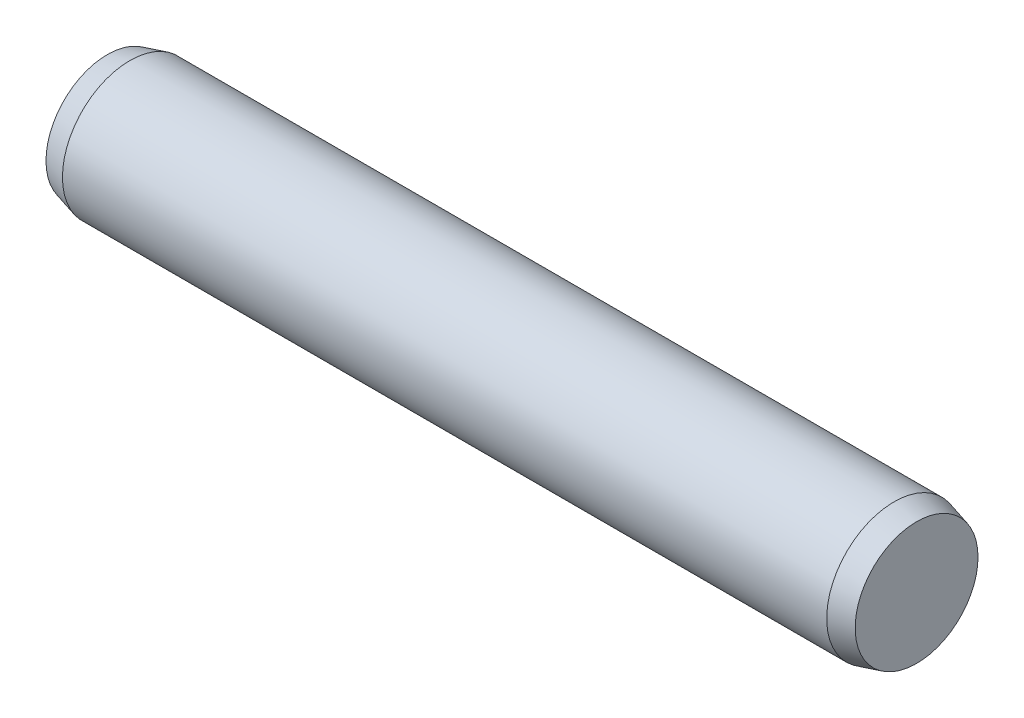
ISO-10303-21;
HEADER;
FILE_DESCRIPTION(('STEP AP214'),'2;1');
FILE_NAME('part.step','',(''),(''),'','','');
FILE_SCHEMA(('AUTOMOTIVE_DESIGN { 1 0 10303 214 1 1 1 1 }'));
ENDSEC;
DATA;
#1=APPLICATION_CONTEXT('core data for automotive mechanical design processes');
#2=APPLICATION_PROTOCOL_DEFINITION('international standard','automotive_design',2000,#1);
#3=PRODUCT_CONTEXT('',#1,'mechanical');
#4=PRODUCT('Part','Part','',(#3));
#5=PRODUCT_RELATED_PRODUCT_CATEGORY('part','',(#4));
#6=PRODUCT_DEFINITION_FORMATION('','',#4);
#7=PRODUCT_DEFINITION_CONTEXT('part definition',#1,'design');
#8=PRODUCT_DEFINITION('design','',#6,#7);
#9=PRODUCT_DEFINITION_SHAPE('','',#8);
#10=(LENGTH_UNIT() NAMED_UNIT(*) SI_UNIT(.MILLI.,.METRE.));
#11=(NAMED_UNIT(*) PLANE_ANGLE_UNIT() SI_UNIT($,.RADIAN.));
#12=(NAMED_UNIT(*) SI_UNIT($,.STERADIAN.) SOLID_ANGLE_UNIT());
#13=UNCERTAINTY_MEASURE_WITH_UNIT(LENGTH_MEASURE(1.E-05),#10,'distance_accuracy_value','');
#14=(GEOMETRIC_REPRESENTATION_CONTEXT(3) GLOBAL_UNCERTAINTY_ASSIGNED_CONTEXT((#13)) GLOBAL_UNIT_ASSIGNED_CONTEXT((#10,
#11,#12)) REPRESENTATION_CONTEXT('',''));
#15=CARTESIAN_POINT('',(0.,0.,0.));
#16=DIRECTION('',(0.,0.,1.));
#17=DIRECTION('',(1.,0.,0.));
#18=AXIS2_PLACEMENT_3D('',#15,#16,#17);
#19=CARTESIAN_POINT('',(-8.5,0.,0.));
#20=DIRECTION('',(1.,0.,0.));
#21=DIRECTION('',(0.,0.,-1.));
#22=AXIS2_PLACEMENT_3D('',#19,#20,#21);
#23=CYLINDRICAL_SURFACE('',#22,1.5);
#24=CARTESIAN_POINT('',(-8.5,0.,0.));
#25=DIRECTION('',(-1.,0.,0.));
#26=DIRECTION('',(0.,0.,1.));
#27=AXIS2_PLACEMENT_3D('',#24,#25,#26);
#28=CIRCLE('',#27,1.5);
#29=CARTESIAN_POINT('',(-8.5,0.,1.5));
#30=VERTEX_POINT('',#29);
#31=EDGE_CURVE('E47',#30,#30,#28,.T.);
#32=ORIENTED_EDGE('',*,*,#31,.F.);
#33=EDGE_LOOP('',(#32));
#34=FACE_BOUND('',#33,.T.);
#35=CARTESIAN_POINT('',(8.5,0.,0.));
#36=DIRECTION('',(1.,0.,0.));
#37=DIRECTION('',(0.,0.,-1.));
#38=AXIS2_PLACEMENT_3D('',#35,#36,#37);
#39=CIRCLE('',#38,1.5);
#40=CARTESIAN_POINT('',(8.5,0.,-1.5));
#41=VERTEX_POINT('',#40);
#42=EDGE_CURVE('E10',#41,#41,#39,.T.);
#43=ORIENTED_EDGE('',*,*,#42,.F.);
#44=EDGE_LOOP('',(#43));
#45=FACE_BOUND('',#44,.T.);
#46=ADVANCED_FACE('F33',(#34,#45),#23,.T.);
#47=CARTESIAN_POINT('',(8.5,0.,0.));
#48=DIRECTION('',(-1.,0.,0.));
#49=DIRECTION('',(0.,0.,-1.));
#50=AXIS2_PLACEMENT_3D('',#47,#48,#49);
#51=CONICAL_SURFACE('',#50,1.5,0.26179938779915);
#52=CARTESIAN_POINT('',(9.,0.,0.));
#53=DIRECTION('',(1.,0.,0.));
#54=DIRECTION('',(0.,0.,-1.));
#55=AXIS2_PLACEMENT_3D('',#52,#53,#54);
#56=CIRCLE('',#55,1.36602540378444);
#57=CARTESIAN_POINT('',(9.,0.,-1.36602540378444));
#58=VERTEX_POINT('',#57);
#59=EDGE_CURVE('E39',#58,#58,#56,.T.);
#60=ORIENTED_EDGE('',*,*,#59,.F.);
#61=EDGE_LOOP('',(#60));
#62=FACE_BOUND('',#61,.T.);
#63=ORIENTED_EDGE('',*,*,#42,.T.);
#64=EDGE_LOOP('',(#63));
#65=FACE_BOUND('',#64,.T.);
#66=ADVANCED_FACE('F57',(#62,#65),#51,.T.);
#67=CARTESIAN_POINT('',(9.,0.,0.));
#68=DIRECTION('',(1.,0.,0.));
#69=DIRECTION('',(0.,0.,-1.));
#70=AXIS2_PLACEMENT_3D('',#67,#68,#69);
#71=PLANE('',#70);
#72=ORIENTED_EDGE('',*,*,#59,.T.);
#73=EDGE_LOOP('',(#72));
#74=FACE_BOUND('',#73,.T.);
#75=ADVANCED_FACE('F61',(#74),#71,.T.);
#76=CARTESIAN_POINT('',(-8.5,0.,0.));
#77=DIRECTION('',(1.,0.,0.));
#78=DIRECTION('',(0.,0.,1.));
#79=AXIS2_PLACEMENT_3D('',#76,#77,#78);
#80=CONICAL_SURFACE('',#79,1.5,0.26179938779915);
#81=CARTESIAN_POINT('',(-9.,0.,0.));
#82=DIRECTION('',(-1.,0.,0.));
#83=DIRECTION('',(0.,0.,1.));
#84=AXIS2_PLACEMENT_3D('',#81,#82,#83);
#85=CIRCLE('',#84,1.36602540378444);
#86=CARTESIAN_POINT('',(-9.,0.,1.36602540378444));
#87=VERTEX_POINT('',#86);
#88=EDGE_CURVE('E43',#87,#87,#85,.T.);
#89=ORIENTED_EDGE('',*,*,#88,.F.);
#90=EDGE_LOOP('',(#89));
#91=FACE_BOUND('',#90,.T.);
#92=ORIENTED_EDGE('',*,*,#31,.T.);
#93=EDGE_LOOP('',(#92));
#94=FACE_BOUND('',#93,.T.);
#95=ADVANCED_FACE('F53',(#91,#94),#80,.T.);
#96=CARTESIAN_POINT('',(-9.,0.,0.));
#97=DIRECTION('',(-1.,0.,0.));
#98=DIRECTION('',(0.,0.,1.));
#99=AXIS2_PLACEMENT_3D('',#96,#97,#98);
#100=PLANE('',#99);
#101=ORIENTED_EDGE('',*,*,#88,.T.);
#102=EDGE_LOOP('',(#101));
#103=FACE_BOUND('',#102,.T.);
#104=ADVANCED_FACE('F70',(#103),#100,.T.);
#105=CLOSED_SHELL('',(#46,#66,#75,#95,#104));
#106=MANIFOLD_SOLID_BREP('B2',#105);
#107=ADVANCED_BREP_SHAPE_REPRESENTATION('',(#18,#106),#14);
#108=SHAPE_DEFINITION_REPRESENTATION(#9,#107);
ENDSEC;
END-ISO-10303-21;
